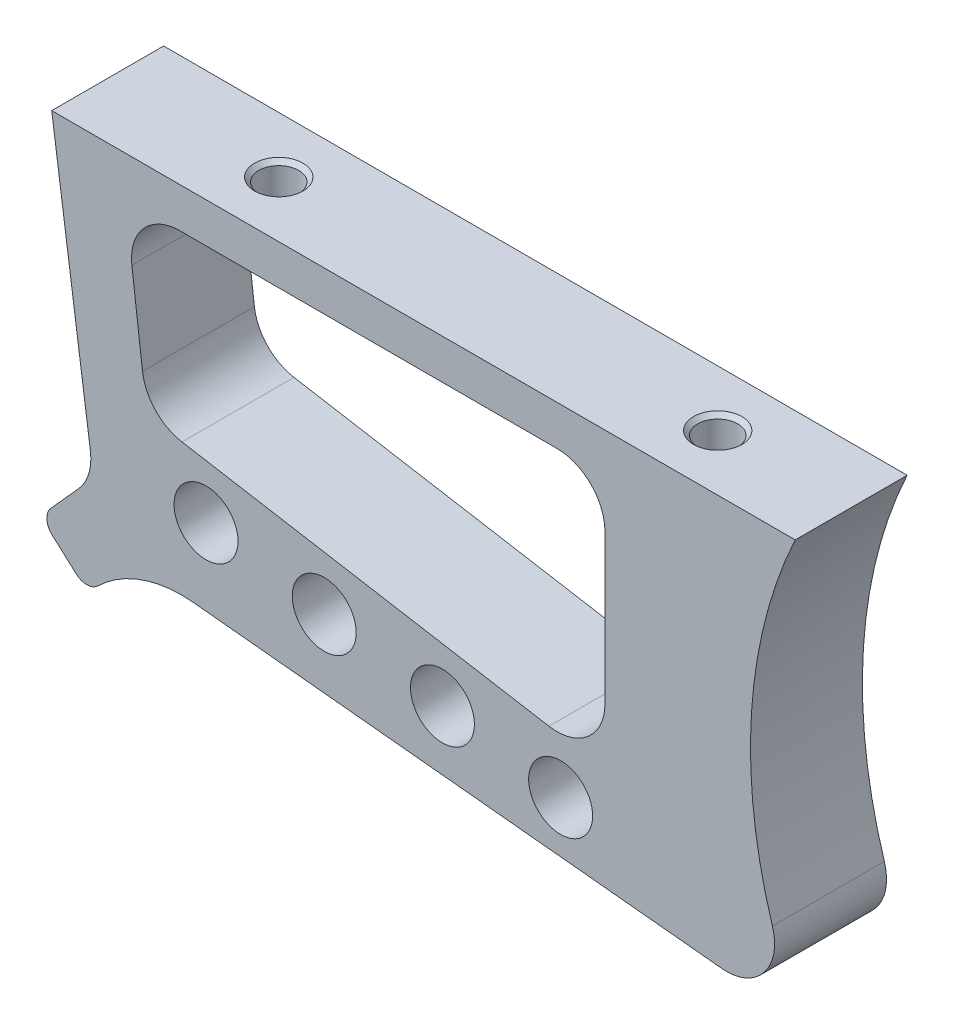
ISO-10303-21;
HEADER;
FILE_DESCRIPTION(('STEP AP214'),'2;1');
FILE_NAME('part.step','',(''),(''),'','','');
FILE_SCHEMA(('AUTOMOTIVE_DESIGN { 1 0 10303 214 1 1 1 1 }'));
ENDSEC;
DATA;
#1=APPLICATION_CONTEXT('core data for automotive mechanical design processes');
#2=APPLICATION_PROTOCOL_DEFINITION('international standard','automotive_design',2000,#1);
#3=PRODUCT_CONTEXT('',#1,'mechanical');
#4=PRODUCT('Part','Part','',(#3));
#5=PRODUCT_RELATED_PRODUCT_CATEGORY('part','',(#4));
#6=PRODUCT_DEFINITION_FORMATION('','',#4);
#7=PRODUCT_DEFINITION_CONTEXT('part definition',#1,'design');
#8=PRODUCT_DEFINITION('design','',#6,#7);
#9=PRODUCT_DEFINITION_SHAPE('','',#8);
#10=(LENGTH_UNIT() NAMED_UNIT(*) SI_UNIT(.MILLI.,.METRE.));
#11=(NAMED_UNIT(*) PLANE_ANGLE_UNIT() SI_UNIT($,.RADIAN.));
#12=(NAMED_UNIT(*) SI_UNIT($,.STERADIAN.) SOLID_ANGLE_UNIT());
#13=UNCERTAINTY_MEASURE_WITH_UNIT(LENGTH_MEASURE(1.E-05),#10,'distance_accuracy_value','');
#14=(GEOMETRIC_REPRESENTATION_CONTEXT(3) GLOBAL_UNCERTAINTY_ASSIGNED_CONTEXT((#13)) GLOBAL_UNIT_ASSIGNED_CONTEXT((#10,
#11,#12)) REPRESENTATION_CONTEXT('',''));
#15=CARTESIAN_POINT('',(0.,0.,0.));
#16=DIRECTION('',(0.,0.,1.));
#17=DIRECTION('',(1.,0.,0.));
#18=AXIS2_PLACEMENT_3D('',#15,#16,#17);
#19=CARTESIAN_POINT('',(147.4,-25.3108672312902,7.));
#20=DIRECTION('',(0.,0.,1.));
#21=DIRECTION('',(1.,0.,0.));
#22=AXIS2_PLACEMENT_3D('',#19,#20,#21);
#23=PLANE('',#22);
#24=CARTESIAN_POINT('',(48.8711040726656,-40.0546813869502,7.));
#25=DIRECTION('',(0.,0.,1.));
#26=DIRECTION('',(1.,0.,0.));
#27=AXIS2_PLACEMENT_3D('',#24,#25,#26);
#28=CIRCLE('',#27,4.);
#29=CARTESIAN_POINT('',(52.8711040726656,-40.0546813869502,7.));
#30=VERTEX_POINT('',#29);
#31=EDGE_CURVE('E237',#30,#30,#28,.T.);
#32=ORIENTED_EDGE('',*,*,#31,.F.);
#33=EDGE_LOOP('',(#32));
#34=FACE_BOUND('',#33,.T.);
#35=CARTESIAN_POINT('',(34.0855520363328,-37.5273406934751,7.));
#36=DIRECTION('',(0.,0.,1.));
#37=DIRECTION('',(1.,0.,0.));
#38=AXIS2_PLACEMENT_3D('',#35,#36,#37);
#39=CIRCLE('',#38,4.);
#40=CARTESIAN_POINT('',(38.0855520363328,-37.5273406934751,7.));
#41=VERTEX_POINT('',#40);
#42=EDGE_CURVE('E249',#41,#41,#39,.T.);
#43=ORIENTED_EDGE('',*,*,#42,.F.);
#44=EDGE_LOOP('',(#43));
#45=FACE_BOUND('',#44,.T.);
#46=DIRECTION('',(0.139173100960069,-0.99026806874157,0.));
#47=VECTOR('',#46,1.);
#48=CARTESIAN_POINT('',(4.83873415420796,-34.4293824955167,7.));
#49=LINE('',#48,#47);
#50=CARTESIAN_POINT('',(0.,0.,7.));
#51=VERTEX_POINT('',#50);
#52=CARTESIAN_POINT('',(4.83873415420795,-34.4293824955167,7.));
#53=VERTEX_POINT('',#52);
#54=EDGE_CURVE('E308',#51,#53,#49,.T.);
#55=ORIENTED_EDGE('',*,*,#54,.T.);
#56=CARTESIAN_POINT('',(-1.10287425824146,-35.2644211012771,7.));
#57=DIRECTION('',(0.,0.,-1.));
#58=DIRECTION('',(1.,0.,0.));
#59=AXIS2_PLACEMENT_3D('',#56,#57,#58);
#60=CIRCLE('',#59,5.99999999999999);
#61=CARTESIAN_POINT('',(3.35599469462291,-39.2792047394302,7.));
#62=VERTEX_POINT('',#61);
#63=EDGE_CURVE('E311',#53,#62,#60,.T.);
#64=ORIENTED_EDGE('',*,*,#63,.T.);
#65=DIRECTION('',(-0.669130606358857,-0.743144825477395,0.));
#66=VECTOR('',#65,1.);
#67=CARTESIAN_POINT('',(-0.0966096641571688,-43.1137103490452,7.));
#68=LINE('',#67,#66);
#69=CARTESIAN_POINT('',(-0.0966096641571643,-43.1137103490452,7.));
#70=VERTEX_POINT('',#69);
#71=EDGE_CURVE('E314',#62,#70,#68,.T.);
#72=ORIENTED_EDGE('',*,*,#71,.T.);
#73=CARTESIAN_POINT('',(1.38967998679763,-44.4519715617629,7.));
#74=DIRECTION('',(0.,0.,1.));
#75=DIRECTION('',(-1.,0.,0.));
#76=AXIS2_PLACEMENT_3D('',#73,#74,#75);
#77=CIRCLE('',#76,2.);
#78=CARTESIAN_POINT('',(0.051418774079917,-45.9382612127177,7.));
#79=VERTEX_POINT('',#78);
#80=EDGE_CURVE('E316',#70,#79,#77,.T.);
#81=ORIENTED_EDGE('',*,*,#80,.T.);
#82=DIRECTION('',(0.743144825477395,-0.669130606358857,0.));
#83=VECTOR('',#82,1.);
#84=CARTESIAN_POINT('',(0.051418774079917,-45.9382612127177,7.));
#85=LINE('',#84,#83);
#86=CARTESIAN_POINT('',(3.05213486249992,-48.6401181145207,7.));
#87=VERTEX_POINT('',#86);
#88=EDGE_CURVE('E318',#79,#87,#85,.T.);
#89=ORIENTED_EDGE('',*,*,#88,.T.);
#90=CARTESIAN_POINT('',(4.39039607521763,-47.1538284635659,7.));
#91=DIRECTION('',(0.,0.,1.));
#92=DIRECTION('',(1.,0.,0.));
#93=AXIS2_PLACEMENT_3D('',#90,#91,#92);
#94=CIRCLE('',#93,2.);
#95=CARTESIAN_POINT('',(5.72865728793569,-48.6401181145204,7.));
#96=VERTEX_POINT('',#95);
#97=EDGE_CURVE('E320',#87,#96,#94,.T.);
#98=ORIENTED_EDGE('',*,*,#97,.T.);
#99=DIRECTION('',(1.,5.95119006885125E-12,0.));
#100=VECTOR('',#99,1.);
#101=CARTESIAN_POINT('',(5.72865728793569,-48.6401181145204,7.));
#102=LINE('',#101,#100);
#103=CARTESIAN_POINT('',(5.73098922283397,-48.6401181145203,7.));
#104=VERTEX_POINT('',#103);
#105=EDGE_CURVE('E322',#96,#104,#102,.T.);
#106=ORIENTED_EDGE('',*,*,#105,.T.);
#107=CARTESIAN_POINT('',(16.236953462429,-59.3464113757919,7.));
#108=DIRECTION('',(0.,0.,-1.));
#109=DIRECTION('',(-1.,0.,0.));
#110=AXIS2_PLACEMENT_3D('',#107,#108,#109);
#111=CIRCLE('',#110,15.);
#112=CARTESIAN_POINT('',(17.7267497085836,-44.4205778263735,7.));
#113=VERTEX_POINT('',#112);
#114=EDGE_CURVE('E324',#104,#113,#111,.T.);
#115=ORIENTED_EDGE('',*,*,#114,.T.);
#116=DIRECTION('',(0.995055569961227,-0.0993197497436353,0.));
#117=VECTOR('',#116,1.);
#118=CARTESIAN_POINT('',(83.8242487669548,-51.0179853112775,7.));
#119=LINE('',#118,#117);
#120=CARTESIAN_POINT('',(83.8242487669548,-51.0179853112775,7.));
#121=VERTEX_POINT('',#120);
#122=EDGE_CURVE('E326',#113,#121,#119,.T.);
#123=ORIENTED_EDGE('',*,*,#122,.T.);
#124=CARTESIAN_POINT('',(84.4201672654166,-45.0476518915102,7.));
#125=DIRECTION('',(0.,0.,1.));
#126=DIRECTION('',(1.,0.,0.));
#127=AXIS2_PLACEMENT_3D('',#124,#125,#126);
#128=CIRCLE('',#127,6.);
#129=CARTESIAN_POINT('',(90.1456066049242,-43.2533987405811,7.));
#130=VERTEX_POINT('',#129);
#131=EDGE_CURVE('E328',#121,#130,#128,.T.);
#132=ORIENTED_EDGE('',*,*,#131,.T.);
#133=CARTESIAN_POINT('',(147.4,-25.3108672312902,7.));
#134=DIRECTION('',(0.,0.,-1.));
#135=DIRECTION('',(1.,0.,0.));
#136=AXIS2_PLACEMENT_3D('',#133,#134,#135);
#137=CIRCLE('',#136,60.);
#138=CARTESIAN_POINT('',(93.,0.,7.));
#139=VERTEX_POINT('',#138);
#140=EDGE_CURVE('E330',#130,#139,#137,.T.);
#141=ORIENTED_EDGE('',*,*,#140,.T.);
#142=DIRECTION('',(-1.,0.,0.));
#143=VECTOR('',#142,1.);
#144=CARTESIAN_POINT('',(0.,0.,7.));
#145=LINE('',#144,#143);
#146=EDGE_CURVE('E332',#139,#51,#145,.T.);
#147=ORIENTED_EDGE('',*,*,#146,.T.);
#148=EDGE_LOOP('',(#55,#64,#72,#81,#89,#98,#106,#115,#123,#132,#141,#147));
#149=FACE_BOUND('',#148,.T.);
#150=DIRECTION('',(0.,1.,0.));
#151=VECTOR('',#150,1.);
#152=CARTESIAN_POINT('',(69.2,-29.6715816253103,7.));
#153=LINE('',#152,#151);
#154=CARTESIAN_POINT('',(69.2,-29.6715816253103,7.));
#155=VERTEX_POINT('',#154);
#156=CARTESIAN_POINT('',(69.2,-11.,7.));
#157=VERTEX_POINT('',#156);
#158=EDGE_CURVE('E256',#155,#157,#153,.T.);
#159=ORIENTED_EDGE('',*,*,#158,.F.);
#160=CARTESIAN_POINT('',(63.2,-29.6715816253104,7.));
#161=DIRECTION('',(0.,0.,1.));
#162=DIRECTION('',(-1.,0.,0.));
#163=AXIS2_PLACEMENT_3D('',#160,#161,#162);
#164=CIRCLE('',#163,6.);
#165=CARTESIAN_POINT('',(62.1890637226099,-35.5858024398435,7.));
#166=VERTEX_POINT('',#165);
#167=EDGE_CURVE('E254',#166,#155,#164,.T.);
#168=ORIENTED_EDGE('',*,*,#167,.F.);
#169=DIRECTION('',(0.985703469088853,-0.168489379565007,0.));
#170=VECTOR('',#169,1.);
#171=CARTESIAN_POINT('',(16.3003009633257,-27.7418925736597,7.));
#172=LINE('',#171,#170);
#173=CARTESIAN_POINT('',(16.3003009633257,-27.7418925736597,7.));
#174=VERTEX_POINT('',#173);
#175=EDGE_CURVE('E269',#174,#166,#172,.T.);
#176=ORIENTED_EDGE('',*,*,#175,.F.);
#177=CARTESIAN_POINT('',(17.3112372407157,-21.8276717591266,7.));
#178=DIRECTION('',(0.,0.,1.));
#179=DIRECTION('',(-1.,0.,0.));
#180=AXIS2_PLACEMENT_3D('',#177,#178,#179);
#181=CIRCLE('',#180,6.);
#182=CARTESIAN_POINT('',(11.3559603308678,-22.5588878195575,7.));
#183=VERTEX_POINT('',#182);
#184=EDGE_CURVE('E267',#183,#174,#181,.T.);
#185=ORIENTED_EDGE('',*,*,#184,.F.);
#186=DIRECTION('',(0.121869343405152,-0.992546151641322,0.));
#187=VECTOR('',#186,1.);
#188=CARTESIAN_POINT('',(10.0264894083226,-11.731216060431,7.));
#189=LINE('',#188,#187);
#190=CARTESIAN_POINT('',(10.0264894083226,-11.731216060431,7.));
#191=VERTEX_POINT('',#190);
#192=EDGE_CURVE('E265',#191,#183,#189,.T.);
#193=ORIENTED_EDGE('',*,*,#192,.F.);
#194=CARTESIAN_POINT('',(15.9817663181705,-11.,7.));
#195=DIRECTION('',(0.,0.,1.));
#196=DIRECTION('',(-1.,0.,0.));
#197=AXIS2_PLACEMENT_3D('',#194,#195,#196);
#198=CIRCLE('',#197,6.);
#199=CARTESIAN_POINT('',(15.9817663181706,-5.00000000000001,7.));
#200=VERTEX_POINT('',#199);
#201=EDGE_CURVE('E263',#200,#191,#198,.T.);
#202=ORIENTED_EDGE('',*,*,#201,.F.);
#203=DIRECTION('',(-1.,0.,0.));
#204=VECTOR('',#203,1.);
#205=CARTESIAN_POINT('',(63.2,-5.,7.));
#206=LINE('',#205,#204);
#207=CARTESIAN_POINT('',(63.2,-4.99999999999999,7.));
#208=VERTEX_POINT('',#207);
#209=EDGE_CURVE('E261',#208,#200,#206,.T.);
#210=ORIENTED_EDGE('',*,*,#209,.F.);
#211=CARTESIAN_POINT('',(63.2,-11.,7.));
#212=DIRECTION('',(0.,0.,1.));
#213=DIRECTION('',(1.,0.,0.));
#214=AXIS2_PLACEMENT_3D('',#211,#212,#213);
#215=CIRCLE('',#214,6.);
#216=EDGE_CURVE('E259',#157,#208,#215,.T.);
#217=ORIENTED_EDGE('',*,*,#216,.F.);
#218=EDGE_LOOP('',(#159,#168,#176,#185,#193,#202,#210,#217));
#219=FACE_BOUND('',#218,.T.);
#220=CARTESIAN_POINT('',(19.3,-35.,7.));
#221=DIRECTION('',(0.,0.,1.));
#222=DIRECTION('',(1.,0.,0.));
#223=AXIS2_PLACEMENT_3D('',#220,#221,#222);
#224=CIRCLE('',#223,4.);
#225=CARTESIAN_POINT('',(23.3,-35.,7.));
#226=VERTEX_POINT('',#225);
#227=EDGE_CURVE('E243',#226,#226,#224,.T.);
#228=ORIENTED_EDGE('',*,*,#227,.F.);
#229=EDGE_LOOP('',(#228));
#230=FACE_BOUND('',#229,.T.);
#231=CARTESIAN_POINT('',(63.6566561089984,-42.5820220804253,7.));
#232=DIRECTION('',(0.,0.,1.));
#233=DIRECTION('',(1.,0.,0.));
#234=AXIS2_PLACEMENT_3D('',#231,#232,#233);
#235=CIRCLE('',#234,4.00000000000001);
#236=CARTESIAN_POINT('',(67.6566561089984,-42.5820220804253,7.));
#237=VERTEX_POINT('',#236);
#238=EDGE_CURVE('E231',#237,#237,#235,.T.);
#239=ORIENTED_EDGE('',*,*,#238,.F.);
#240=EDGE_LOOP('',(#239));
#241=FACE_BOUND('',#240,.T.);
#242=ADVANCED_FACE('F49',(#34,#45,#149,#219,#230,#241),#23,.T.);
#243=CARTESIAN_POINT('',(147.4,-25.3108672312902,-7.));
#244=DIRECTION('',(0.,0.,1.));
#245=DIRECTION('',(1.,0.,0.));
#246=AXIS2_PLACEMENT_3D('',#243,#244,#245);
#247=PLANE('',#246);
#248=DIRECTION('',(0.139173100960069,-0.99026806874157,0.));
#249=VECTOR('',#248,1.);
#250=CARTESIAN_POINT('',(4.83873415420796,-34.4293824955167,-7.));
#251=LINE('',#250,#249);
#252=CARTESIAN_POINT('',(0.,0.,-7.));
#253=VERTEX_POINT('',#252);
#254=CARTESIAN_POINT('',(4.83873415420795,-34.4293824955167,-7.));
#255=VERTEX_POINT('',#254);
#256=EDGE_CURVE('E307',#253,#255,#251,.T.);
#257=ORIENTED_EDGE('',*,*,#256,.F.);
#258=DIRECTION('',(-1.,0.,0.));
#259=VECTOR('',#258,1.);
#260=CARTESIAN_POINT('',(0.,0.,-7.));
#261=LINE('',#260,#259);
#262=CARTESIAN_POINT('',(93.,0.,-7.));
#263=VERTEX_POINT('',#262);
#264=EDGE_CURVE('E312',#263,#253,#261,.T.);
#265=ORIENTED_EDGE('',*,*,#264,.F.);
#266=CARTESIAN_POINT('',(147.4,-25.3108672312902,-7.));
#267=DIRECTION('',(0.,0.,-1.));
#268=DIRECTION('',(1.,0.,0.));
#269=AXIS2_PLACEMENT_3D('',#266,#267,#268);
#270=CIRCLE('',#269,60.);
#271=CARTESIAN_POINT('',(90.1456066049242,-43.2533987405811,-7.));
#272=VERTEX_POINT('',#271);
#273=EDGE_CURVE('E355',#272,#263,#270,.T.);
#274=ORIENTED_EDGE('',*,*,#273,.F.);
#275=CARTESIAN_POINT('',(84.4201672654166,-45.0476518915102,-7.));
#276=DIRECTION('',(0.,0.,1.));
#277=DIRECTION('',(1.,0.,0.));
#278=AXIS2_PLACEMENT_3D('',#275,#276,#277);
#279=CIRCLE('',#278,6.);
#280=CARTESIAN_POINT('',(83.8242487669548,-51.0179853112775,-7.));
#281=VERTEX_POINT('',#280);
#282=EDGE_CURVE('E353',#281,#272,#279,.T.);
#283=ORIENTED_EDGE('',*,*,#282,.F.);
#284=DIRECTION('',(0.995055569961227,-0.0993197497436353,0.));
#285=VECTOR('',#284,1.);
#286=CARTESIAN_POINT('',(83.8242487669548,-51.0179853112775,-7.));
#287=LINE('',#286,#285);
#288=CARTESIAN_POINT('',(17.7267497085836,-44.4205778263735,-7.));
#289=VERTEX_POINT('',#288);
#290=EDGE_CURVE('E351',#289,#281,#287,.T.);
#291=ORIENTED_EDGE('',*,*,#290,.F.);
#292=CARTESIAN_POINT('',(16.236953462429,-59.3464113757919,-7.));
#293=DIRECTION('',(0.,0.,-1.));
#294=DIRECTION('',(-1.,0.,0.));
#295=AXIS2_PLACEMENT_3D('',#292,#293,#294);
#296=CIRCLE('',#295,15.);
#297=CARTESIAN_POINT('',(5.73098922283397,-48.6401181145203,-7.));
#298=VERTEX_POINT('',#297);
#299=EDGE_CURVE('E349',#298,#289,#296,.T.);
#300=ORIENTED_EDGE('',*,*,#299,.F.);
#301=DIRECTION('',(1.,5.95119006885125E-12,0.));
#302=VECTOR('',#301,1.);
#303=CARTESIAN_POINT('',(5.72865728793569,-48.6401181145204,-7.));
#304=LINE('',#303,#302);
#305=CARTESIAN_POINT('',(5.72865728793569,-48.6401181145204,-7.));
#306=VERTEX_POINT('',#305);
#307=EDGE_CURVE('E347',#306,#298,#304,.T.);
#308=ORIENTED_EDGE('',*,*,#307,.F.);
#309=CARTESIAN_POINT('',(4.39039607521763,-47.1538284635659,-7.));
#310=DIRECTION('',(0.,0.,1.));
#311=DIRECTION('',(1.,0.,0.));
#312=AXIS2_PLACEMENT_3D('',#309,#310,#311);
#313=CIRCLE('',#312,2.);
#314=CARTESIAN_POINT('',(3.05213486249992,-48.6401181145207,-7.));
#315=VERTEX_POINT('',#314);
#316=EDGE_CURVE('E345',#315,#306,#313,.T.);
#317=ORIENTED_EDGE('',*,*,#316,.F.);
#318=DIRECTION('',(0.743144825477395,-0.669130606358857,0.));
#319=VECTOR('',#318,1.);
#320=CARTESIAN_POINT('',(0.051418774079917,-45.9382612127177,-7.));
#321=LINE('',#320,#319);
#322=CARTESIAN_POINT('',(0.051418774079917,-45.9382612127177,-7.));
#323=VERTEX_POINT('',#322);
#324=EDGE_CURVE('E343',#323,#315,#321,.T.);
#325=ORIENTED_EDGE('',*,*,#324,.F.);
#326=CARTESIAN_POINT('',(1.38967998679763,-44.4519715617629,-7.));
#327=DIRECTION('',(0.,0.,1.));
#328=DIRECTION('',(-1.,0.,0.));
#329=AXIS2_PLACEMENT_3D('',#326,#327,#328);
#330=CIRCLE('',#329,2.);
#331=CARTESIAN_POINT('',(-0.0966096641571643,-43.1137103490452,-7.));
#332=VERTEX_POINT('',#331);
#333=EDGE_CURVE('E341',#332,#323,#330,.T.);
#334=ORIENTED_EDGE('',*,*,#333,.F.);
#335=DIRECTION('',(-0.669130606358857,-0.743144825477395,0.));
#336=VECTOR('',#335,1.);
#337=CARTESIAN_POINT('',(-0.0966096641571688,-43.1137103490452,-7.));
#338=LINE('',#337,#336);
#339=CARTESIAN_POINT('',(3.35599469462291,-39.2792047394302,-7.));
#340=VERTEX_POINT('',#339);
#341=EDGE_CURVE('E339',#340,#332,#338,.T.);
#342=ORIENTED_EDGE('',*,*,#341,.F.);
#343=CARTESIAN_POINT('',(-1.10287425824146,-35.2644211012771,-7.));
#344=DIRECTION('',(0.,0.,-1.));
#345=DIRECTION('',(1.,0.,0.));
#346=AXIS2_PLACEMENT_3D('',#343,#344,#345);
#347=CIRCLE('',#346,5.99999999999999);
#348=EDGE_CURVE('E337',#255,#340,#347,.T.);
#349=ORIENTED_EDGE('',*,*,#348,.F.);
#350=EDGE_LOOP('',(#257,#265,#274,#283,#291,#300,#308,#317,#325,#334,#342,#349));
#351=FACE_BOUND('',#350,.T.);
#352=CARTESIAN_POINT('',(63.2,-29.6715816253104,-7.));
#353=DIRECTION('',(0.,0.,1.));
#354=DIRECTION('',(-1.,0.,0.));
#355=AXIS2_PLACEMENT_3D('',#352,#353,#354);
#356=CIRCLE('',#355,6.);
#357=CARTESIAN_POINT('',(62.1890637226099,-35.5858024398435,-7.));
#358=VERTEX_POINT('',#357);
#359=CARTESIAN_POINT('',(69.2,-29.6715816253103,-7.));
#360=VERTEX_POINT('',#359);
#361=EDGE_CURVE('E74',#358,#360,#356,.T.);
#362=ORIENTED_EDGE('',*,*,#361,.T.);
#363=DIRECTION('',(0.,1.,0.));
#364=VECTOR('',#363,1.);
#365=CARTESIAN_POINT('',(69.2,-29.6715816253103,-7.));
#366=LINE('',#365,#364);
#367=CARTESIAN_POINT('',(69.2,-11.,-7.));
#368=VERTEX_POINT('',#367);
#369=EDGE_CURVE('E273',#360,#368,#366,.T.);
#370=ORIENTED_EDGE('',*,*,#369,.T.);
#371=CARTESIAN_POINT('',(63.2,-11.,-7.));
#372=DIRECTION('',(0.,0.,1.));
#373=DIRECTION('',(1.,0.,0.));
#374=AXIS2_PLACEMENT_3D('',#371,#372,#373);
#375=CIRCLE('',#374,6.);
#376=CARTESIAN_POINT('',(63.2,-4.99999999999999,-7.));
#377=VERTEX_POINT('',#376);
#378=EDGE_CURVE('E276',#368,#377,#375,.T.);
#379=ORIENTED_EDGE('',*,*,#378,.T.);
#380=DIRECTION('',(-1.,0.,0.));
#381=VECTOR('',#380,1.);
#382=CARTESIAN_POINT('',(63.2,-5.,-7.));
#383=LINE('',#382,#381);
#384=CARTESIAN_POINT('',(15.9817663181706,-5.00000000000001,-7.));
#385=VERTEX_POINT('',#384);
#386=EDGE_CURVE('E279',#377,#385,#383,.T.);
#387=ORIENTED_EDGE('',*,*,#386,.T.);
#388=CARTESIAN_POINT('',(15.9817663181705,-11.,-7.));
#389=DIRECTION('',(0.,0.,1.));
#390=DIRECTION('',(-1.,0.,0.));
#391=AXIS2_PLACEMENT_3D('',#388,#389,#390);
#392=CIRCLE('',#391,6.);
#393=CARTESIAN_POINT('',(10.0264894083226,-11.731216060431,-7.));
#394=VERTEX_POINT('',#393);
#395=EDGE_CURVE('E282',#385,#394,#392,.T.);
#396=ORIENTED_EDGE('',*,*,#395,.T.);
#397=DIRECTION('',(0.121869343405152,-0.992546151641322,0.));
#398=VECTOR('',#397,1.);
#399=CARTESIAN_POINT('',(10.0264894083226,-11.731216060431,-7.));
#400=LINE('',#399,#398);
#401=CARTESIAN_POINT('',(11.3559603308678,-22.5588878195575,-7.));
#402=VERTEX_POINT('',#401);
#403=EDGE_CURVE('E285',#394,#402,#400,.T.);
#404=ORIENTED_EDGE('',*,*,#403,.T.);
#405=CARTESIAN_POINT('',(17.3112372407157,-21.8276717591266,-7.));
#406=DIRECTION('',(0.,0.,1.));
#407=DIRECTION('',(-1.,0.,0.));
#408=AXIS2_PLACEMENT_3D('',#405,#406,#407);
#409=CIRCLE('',#408,6.);
#410=CARTESIAN_POINT('',(16.3003009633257,-27.7418925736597,-7.));
#411=VERTEX_POINT('',#410);
#412=EDGE_CURVE('E288',#402,#411,#409,.T.);
#413=ORIENTED_EDGE('',*,*,#412,.T.);
#414=DIRECTION('',(0.985703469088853,-0.168489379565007,0.));
#415=VECTOR('',#414,1.);
#416=CARTESIAN_POINT('',(16.3003009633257,-27.7418925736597,-7.));
#417=LINE('',#416,#415);
#418=EDGE_CURVE('E257',#411,#358,#417,.T.);
#419=ORIENTED_EDGE('',*,*,#418,.T.);
#420=EDGE_LOOP('',(#362,#370,#379,#387,#396,#404,#413,#419));
#421=FACE_BOUND('',#420,.T.);
#422=CARTESIAN_POINT('',(34.0855520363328,-37.5273406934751,-7.));
#423=DIRECTION('',(0.,0.,1.));
#424=DIRECTION('',(1.,0.,0.));
#425=AXIS2_PLACEMENT_3D('',#422,#423,#424);
#426=CIRCLE('',#425,4.);
#427=CARTESIAN_POINT('',(38.0855520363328,-37.5273406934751,-7.));
#428=VERTEX_POINT('',#427);
#429=EDGE_CURVE('E246',#428,#428,#426,.T.);
#430=ORIENTED_EDGE('',*,*,#429,.T.);
#431=EDGE_LOOP('',(#430));
#432=FACE_BOUND('',#431,.T.);
#433=CARTESIAN_POINT('',(19.3,-35.,-7.));
#434=DIRECTION('',(0.,0.,1.));
#435=DIRECTION('',(1.,0.,0.));
#436=AXIS2_PLACEMENT_3D('',#433,#434,#435);
#437=CIRCLE('',#436,4.);
#438=CARTESIAN_POINT('',(23.3,-35.,-7.));
#439=VERTEX_POINT('',#438);
#440=EDGE_CURVE('E240',#439,#439,#437,.T.);
#441=ORIENTED_EDGE('',*,*,#440,.T.);
#442=EDGE_LOOP('',(#441));
#443=FACE_BOUND('',#442,.T.);
#444=CARTESIAN_POINT('',(48.8711040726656,-40.0546813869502,-7.));
#445=DIRECTION('',(0.,0.,1.));
#446=DIRECTION('',(1.,0.,0.));
#447=AXIS2_PLACEMENT_3D('',#444,#445,#446);
#448=CIRCLE('',#447,4.);
#449=CARTESIAN_POINT('',(52.8711040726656,-40.0546813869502,-7.));
#450=VERTEX_POINT('',#449);
#451=EDGE_CURVE('E234',#450,#450,#448,.T.);
#452=ORIENTED_EDGE('',*,*,#451,.T.);
#453=EDGE_LOOP('',(#452));
#454=FACE_BOUND('',#453,.T.);
#455=CARTESIAN_POINT('',(63.6566561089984,-42.5820220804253,-7.));
#456=DIRECTION('',(0.,0.,1.));
#457=DIRECTION('',(1.,0.,0.));
#458=AXIS2_PLACEMENT_3D('',#455,#456,#457);
#459=CIRCLE('',#458,4.00000000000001);
#460=CARTESIAN_POINT('',(67.6566561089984,-42.5820220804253,-7.));
#461=VERTEX_POINT('',#460);
#462=EDGE_CURVE('E230',#461,#461,#459,.T.);
#463=ORIENTED_EDGE('',*,*,#462,.T.);
#464=EDGE_LOOP('',(#463));
#465=FACE_BOUND('',#464,.T.);
#466=ADVANCED_FACE('F407',(#351,#421,#432,#443,#454,#465),#247,.F.);
#467=CARTESIAN_POINT('',(4.83873415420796,-34.4293824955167,7.));
#468=DIRECTION('',(0.99026806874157,0.139173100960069,0.));
#469=DIRECTION('',(-0.139173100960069,0.99026806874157,0.));
#470=AXIS2_PLACEMENT_3D('',#467,#468,#469);
#471=PLANE('',#470);
#472=ORIENTED_EDGE('',*,*,#256,.T.);
#473=DIRECTION('',(0.,0.,-1.));
#474=VECTOR('',#473,1.);
#475=CARTESIAN_POINT('',(4.83873415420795,-34.4293824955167,7.));
#476=LINE('',#475,#474);
#477=EDGE_CURVE('E11',#53,#255,#476,.T.);
#478=ORIENTED_EDGE('',*,*,#477,.F.);
#479=ORIENTED_EDGE('',*,*,#54,.F.);
#480=DIRECTION('',(0.,0.,-1.));
#481=VECTOR('',#480,1.);
#482=CARTESIAN_POINT('',(0.,0.,7.));
#483=LINE('',#482,#481);
#484=EDGE_CURVE('E334',#51,#253,#483,.T.);
#485=ORIENTED_EDGE('',*,*,#484,.T.);
#486=EDGE_LOOP('',(#472,#478,#479,#485));
#487=FACE_BOUND('',#486,.T.);
#488=ADVANCED_FACE('F51',(#487),#471,.F.);
#489=CARTESIAN_POINT('',(-1.10287425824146,-35.2644211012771,7.));
#490=DIRECTION('',(0.,0.,-1.));
#491=DIRECTION('',(-1.,0.,0.));
#492=AXIS2_PLACEMENT_3D('',#489,#490,#491);
#493=CYLINDRICAL_SURFACE('',#492,5.99999999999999);
#494=ORIENTED_EDGE('',*,*,#348,.T.);
#495=DIRECTION('',(0.,0.,-1.));
#496=VECTOR('',#495,1.);
#497=CARTESIAN_POINT('',(3.35599469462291,-39.2792047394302,7.));
#498=LINE('',#497,#496);
#499=EDGE_CURVE('E58',#62,#340,#498,.T.);
#500=ORIENTED_EDGE('',*,*,#499,.F.);
#501=ORIENTED_EDGE('',*,*,#63,.F.);
#502=ORIENTED_EDGE('',*,*,#477,.T.);
#503=EDGE_LOOP('',(#494,#500,#501,#502));
#504=FACE_BOUND('',#503,.T.);
#505=ADVANCED_FACE('F491',(#504),#493,.F.);
#506=CARTESIAN_POINT('',(-0.0966096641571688,-43.1137103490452,7.));
#507=DIRECTION('',(0.743144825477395,-0.669130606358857,0.));
#508=DIRECTION('',(0.669130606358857,0.743144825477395,0.));
#509=AXIS2_PLACEMENT_3D('',#506,#507,#508);
#510=PLANE('',#509);
#511=ORIENTED_EDGE('',*,*,#341,.T.);
#512=DIRECTION('',(0.,0.,-1.));
#513=VECTOR('',#512,1.);
#514=CARTESIAN_POINT('',(-0.0966096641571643,-43.1137103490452,7.));
#515=LINE('',#514,#513);
#516=EDGE_CURVE('E384',#70,#332,#515,.T.);
#517=ORIENTED_EDGE('',*,*,#516,.F.);
#518=ORIENTED_EDGE('',*,*,#71,.F.);
#519=ORIENTED_EDGE('',*,*,#499,.T.);
#520=EDGE_LOOP('',(#511,#517,#518,#519));
#521=FACE_BOUND('',#520,.T.);
#522=ADVANCED_FACE('F488',(#521),#510,.F.);
#523=CARTESIAN_POINT('',(1.38967998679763,-44.4519715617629,7.));
#524=DIRECTION('',(0.,0.,-1.));
#525=DIRECTION('',(-1.,0.,0.));
#526=AXIS2_PLACEMENT_3D('',#523,#524,#525);
#527=CYLINDRICAL_SURFACE('',#526,2.);
#528=ORIENTED_EDGE('',*,*,#333,.T.);
#529=DIRECTION('',(0.,0.,-1.));
#530=VECTOR('',#529,1.);
#531=CARTESIAN_POINT('',(0.051418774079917,-45.9382612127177,7.));
#532=LINE('',#531,#530);
#533=EDGE_CURVE('E381',#79,#323,#532,.T.);
#534=ORIENTED_EDGE('',*,*,#533,.F.);
#535=ORIENTED_EDGE('',*,*,#80,.F.);
#536=ORIENTED_EDGE('',*,*,#516,.T.);
#537=EDGE_LOOP('',(#528,#534,#535,#536));
#538=FACE_BOUND('',#537,.T.);
#539=ADVANCED_FACE('F484',(#538),#527,.T.);
#540=CARTESIAN_POINT('',(0.051418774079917,-45.9382612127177,7.));
#541=DIRECTION('',(0.669130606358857,0.743144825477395,0.));
#542=DIRECTION('',(-0.743144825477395,0.669130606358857,0.));
#543=AXIS2_PLACEMENT_3D('',#540,#541,#542);
#544=PLANE('',#543);
#545=ORIENTED_EDGE('',*,*,#324,.T.);
#546=DIRECTION('',(0.,0.,-1.));
#547=VECTOR('',#546,1.);
#548=CARTESIAN_POINT('',(3.05213486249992,-48.6401181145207,7.));
#549=LINE('',#548,#547);
#550=EDGE_CURVE('E378',#87,#315,#549,.T.);
#551=ORIENTED_EDGE('',*,*,#550,.F.);
#552=ORIENTED_EDGE('',*,*,#88,.F.);
#553=ORIENTED_EDGE('',*,*,#533,.T.);
#554=EDGE_LOOP('',(#545,#551,#552,#553));
#555=FACE_BOUND('',#554,.T.);
#556=ADVANCED_FACE('F480',(#555),#544,.F.);
#557=CARTESIAN_POINT('',(4.39039607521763,-47.1538284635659,7.));
#558=DIRECTION('',(0.,0.,-1.));
#559=DIRECTION('',(-1.,0.,0.));
#560=AXIS2_PLACEMENT_3D('',#557,#558,#559);
#561=CYLINDRICAL_SURFACE('',#560,2.);
#562=ORIENTED_EDGE('',*,*,#316,.T.);
#563=DIRECTION('',(0.,0.,-1.));
#564=VECTOR('',#563,1.);
#565=CARTESIAN_POINT('',(5.72865728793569,-48.6401181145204,7.));
#566=LINE('',#565,#564);
#567=EDGE_CURVE('E375',#96,#306,#566,.T.);
#568=ORIENTED_EDGE('',*,*,#567,.F.);
#569=ORIENTED_EDGE('',*,*,#97,.F.);
#570=ORIENTED_EDGE('',*,*,#550,.T.);
#571=EDGE_LOOP('',(#562,#568,#569,#570));
#572=FACE_BOUND('',#571,.T.);
#573=ADVANCED_FACE('F476',(#572),#561,.T.);
#574=CARTESIAN_POINT('',(5.72865728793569,-48.6401181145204,7.));
#575=DIRECTION('',(-5.95119006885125E-12,1.,0.));
#576=DIRECTION('',(-1.,-5.95119006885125E-12,0.));
#577=AXIS2_PLACEMENT_3D('',#574,#575,#576);
#578=PLANE('',#577);
#579=ORIENTED_EDGE('',*,*,#307,.T.);
#580=DIRECTION('',(0.,0.,-1.));
#581=VECTOR('',#580,1.);
#582=CARTESIAN_POINT('',(5.73098922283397,-48.6401181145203,7.));
#583=LINE('',#582,#581);
#584=EDGE_CURVE('E372',#104,#298,#583,.T.);
#585=ORIENTED_EDGE('',*,*,#584,.F.);
#586=ORIENTED_EDGE('',*,*,#105,.F.);
#587=ORIENTED_EDGE('',*,*,#567,.T.);
#588=EDGE_LOOP('',(#579,#585,#586,#587));
#589=FACE_BOUND('',#588,.T.);
#590=ADVANCED_FACE('F472',(#589),#578,.F.);
#591=CARTESIAN_POINT('',(16.236953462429,-59.3464113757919,7.));
#592=DIRECTION('',(0.,0.,-1.));
#593=DIRECTION('',(-1.,0.,0.));
#594=AXIS2_PLACEMENT_3D('',#591,#592,#593);
#595=CYLINDRICAL_SURFACE('',#594,15.);
#596=ORIENTED_EDGE('',*,*,#299,.T.);
#597=DIRECTION('',(0.,0.,-1.));
#598=VECTOR('',#597,1.);
#599=CARTESIAN_POINT('',(17.7267497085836,-44.4205778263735,7.));
#600=LINE('',#599,#598);
#601=EDGE_CURVE('E369',#113,#289,#600,.T.);
#602=ORIENTED_EDGE('',*,*,#601,.F.);
#603=ORIENTED_EDGE('',*,*,#114,.F.);
#604=ORIENTED_EDGE('',*,*,#584,.T.);
#605=EDGE_LOOP('',(#596,#602,#603,#604));
#606=FACE_BOUND('',#605,.T.);
#607=ADVANCED_FACE('F468',(#606),#595,.F.);
#608=CARTESIAN_POINT('',(83.8242487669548,-51.0179853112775,7.));
#609=DIRECTION('',(0.0993197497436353,0.995055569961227,0.));
#610=DIRECTION('',(-0.995055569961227,0.0993197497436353,0.));
#611=AXIS2_PLACEMENT_3D('',#608,#609,#610);
#612=PLANE('',#611);
#613=CARTESIAN_POINT('',(74.4,-50.0773202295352,0.));
#614=DIRECTION('',(0.0993197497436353,0.995055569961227,0.));
#615=DIRECTION('',(-0.995055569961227,0.0993197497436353,0.));
#616=AXIS2_PLACEMENT_3D('',#613,#614,#615);
#617=ELLIPSE('',#616,6.02981399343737,6.);
#618=CARTESIAN_POINT('',(68.4,-49.4784406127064,0.));
#619=VERTEX_POINT('',#618);
#620=EDGE_CURVE('E53',#619,#619,#617,.T.);
#621=ORIENTED_EDGE('',*,*,#620,.T.);
#622=EDGE_LOOP('',(#621));
#623=FACE_BOUND('',#622,.T.);
#624=ORIENTED_EDGE('',*,*,#290,.T.);
#625=DIRECTION('',(0.,0.,-1.));
#626=VECTOR('',#625,1.);
#627=CARTESIAN_POINT('',(83.8242487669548,-51.0179853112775,7.));
#628=LINE('',#627,#626);
#629=EDGE_CURVE('E366',#121,#281,#628,.T.);
#630=ORIENTED_EDGE('',*,*,#629,.F.);
#631=ORIENTED_EDGE('',*,*,#122,.F.);
#632=ORIENTED_EDGE('',*,*,#601,.T.);
#633=EDGE_LOOP('',(#624,#630,#631,#632));
#634=FACE_BOUND('',#633,.T.);
#635=ADVANCED_FACE('F464',(#623,#634),#612,.F.);
#636=CARTESIAN_POINT('',(84.4201672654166,-45.0476518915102,7.));
#637=DIRECTION('',(0.,0.,-1.));
#638=DIRECTION('',(-1.,0.,0.));
#639=AXIS2_PLACEMENT_3D('',#636,#637,#638);
#640=CYLINDRICAL_SURFACE('',#639,6.);
#641=ORIENTED_EDGE('',*,*,#282,.T.);
#642=DIRECTION('',(0.,0.,-1.));
#643=VECTOR('',#642,1.);
#644=CARTESIAN_POINT('',(90.1456066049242,-43.2533987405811,7.));
#645=LINE('',#644,#643);
#646=EDGE_CURVE('E363',#130,#272,#645,.T.);
#647=ORIENTED_EDGE('',*,*,#646,.F.);
#648=ORIENTED_EDGE('',*,*,#131,.F.);
#649=ORIENTED_EDGE('',*,*,#629,.T.);
#650=EDGE_LOOP('',(#641,#647,#648,#649));
#651=FACE_BOUND('',#650,.T.);
#652=ADVANCED_FACE('F460',(#651),#640,.T.);
#653=CARTESIAN_POINT('',(147.4,-25.3108672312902,7.));
#654=DIRECTION('',(0.,0.,-1.));
#655=DIRECTION('',(-1.,0.,0.));
#656=AXIS2_PLACEMENT_3D('',#653,#654,#655);
#657=CYLINDRICAL_SURFACE('',#656,60.);
#658=ORIENTED_EDGE('',*,*,#273,.T.);
#659=DIRECTION('',(0.,0.,-1.));
#660=VECTOR('',#659,1.);
#661=CARTESIAN_POINT('',(93.,0.,7.));
#662=LINE('',#661,#660);
#663=EDGE_CURVE('E360',#139,#263,#662,.T.);
#664=ORIENTED_EDGE('',*,*,#663,.F.);
#665=ORIENTED_EDGE('',*,*,#140,.F.);
#666=ORIENTED_EDGE('',*,*,#646,.T.);
#667=EDGE_LOOP('',(#658,#664,#665,#666));
#668=FACE_BOUND('',#667,.T.);
#669=ADVANCED_FACE('F456',(#668),#657,.F.);
#670=CARTESIAN_POINT('',(0.,0.,7.));
#671=DIRECTION('',(0.,-1.,0.));
#672=DIRECTION('',(0.,0.,-1.));
#673=AXIS2_PLACEMENT_3D('',#670,#671,#672);
#674=PLANE('',#673);
#675=CARTESIAN_POINT('',(21.4,0.,0.));
#676=DIRECTION('',(0.,1.,0.));
#677=DIRECTION('',(0.,0.,1.));
#678=AXIS2_PLACEMENT_3D('',#675,#676,#677);
#679=CIRCLE('',#678,3.025);
#680=CARTESIAN_POINT('',(21.4,0.,3.025));
#681=VERTEX_POINT('',#680);
#682=EDGE_CURVE('E214',#681,#681,#679,.T.);
#683=ORIENTED_EDGE('',*,*,#682,.F.);
#684=EDGE_LOOP('',(#683));
#685=FACE_BOUND('',#684,.T.);
#686=CARTESIAN_POINT('',(76.3033903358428,0.,0.));
#687=DIRECTION('',(0.,1.,0.));
#688=DIRECTION('',(0.,0.,1.));
#689=AXIS2_PLACEMENT_3D('',#686,#687,#688);
#690=CIRCLE('',#689,3.025);
#691=CARTESIAN_POINT('',(76.3033903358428,0.,3.025));
#692=VERTEX_POINT('',#691);
#693=EDGE_CURVE('E221',#692,#692,#690,.T.);
#694=ORIENTED_EDGE('',*,*,#693,.F.);
#695=EDGE_LOOP('',(#694));
#696=FACE_BOUND('',#695,.T.);
#697=ORIENTED_EDGE('',*,*,#264,.T.);
#698=ORIENTED_EDGE('',*,*,#484,.F.);
#699=ORIENTED_EDGE('',*,*,#146,.F.);
#700=ORIENTED_EDGE('',*,*,#663,.T.);
#701=EDGE_LOOP('',(#697,#698,#699,#700));
#702=FACE_BOUND('',#701,.T.);
#703=ADVANCED_FACE('F441',(#685,#696,#702),#674,.F.);
#704=CARTESIAN_POINT('',(63.2,-29.6715816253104,7.));
#705=DIRECTION('',(0.,0.,-1.));
#706=DIRECTION('',(-1.,0.,0.));
#707=AXIS2_PLACEMENT_3D('',#704,#705,#706);
#708=CYLINDRICAL_SURFACE('',#707,6.);
#709=ORIENTED_EDGE('',*,*,#361,.F.);
#710=DIRECTION('',(0.,0.,-1.));
#711=VECTOR('',#710,1.);
#712=CARTESIAN_POINT('',(62.1890637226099,-35.5858024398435,7.));
#713=LINE('',#712,#711);
#714=EDGE_CURVE('E271',#166,#358,#713,.T.);
#715=ORIENTED_EDGE('',*,*,#714,.F.);
#716=ORIENTED_EDGE('',*,*,#167,.T.);
#717=DIRECTION('',(0.,0.,-1.));
#718=VECTOR('',#717,1.);
#719=CARTESIAN_POINT('',(69.2,-29.6715816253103,7.));
#720=LINE('',#719,#718);
#721=EDGE_CURVE('E305',#155,#360,#720,.T.);
#722=ORIENTED_EDGE('',*,*,#721,.T.);
#723=EDGE_LOOP('',(#709,#715,#716,#722));
#724=FACE_BOUND('',#723,.T.);
#725=ADVANCED_FACE('F430',(#724),#708,.F.);
#726=CARTESIAN_POINT('',(69.2,-29.6715816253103,7.));
#727=DIRECTION('',(-1.,0.,0.));
#728=DIRECTION('',(0.,0.,1.));
#729=AXIS2_PLACEMENT_3D('',#726,#727,#728);
#730=PLANE('',#729);
#731=ORIENTED_EDGE('',*,*,#369,.F.);
#732=ORIENTED_EDGE('',*,*,#721,.F.);
#733=ORIENTED_EDGE('',*,*,#158,.T.);
#734=DIRECTION('',(0.,0.,-1.));
#735=VECTOR('',#734,1.);
#736=CARTESIAN_POINT('',(69.2,-11.,7.));
#737=LINE('',#736,#735);
#738=EDGE_CURVE('E303',#157,#368,#737,.T.);
#739=ORIENTED_EDGE('',*,*,#738,.T.);
#740=EDGE_LOOP('',(#731,#732,#733,#739));
#741=FACE_BOUND('',#740,.T.);
#742=ADVANCED_FACE('F433',(#741),#730,.T.);
#743=CARTESIAN_POINT('',(63.2,-11.,7.));
#744=DIRECTION('',(0.,0.,-1.));
#745=DIRECTION('',(-1.,0.,0.));
#746=AXIS2_PLACEMENT_3D('',#743,#744,#745);
#747=CYLINDRICAL_SURFACE('',#746,6.);
#748=ORIENTED_EDGE('',*,*,#378,.F.);
#749=ORIENTED_EDGE('',*,*,#738,.F.);
#750=ORIENTED_EDGE('',*,*,#216,.T.);
#751=DIRECTION('',(0.,0.,-1.));
#752=VECTOR('',#751,1.);
#753=CARTESIAN_POINT('',(63.2,-4.99999999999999,7.));
#754=LINE('',#753,#752);
#755=EDGE_CURVE('E301',#208,#377,#754,.T.);
#756=ORIENTED_EDGE('',*,*,#755,.T.);
#757=EDGE_LOOP('',(#748,#749,#750,#756));
#758=FACE_BOUND('',#757,.T.);
#759=ADVANCED_FACE('F398',(#758),#747,.F.);
#760=CARTESIAN_POINT('',(63.2,-5.,7.));
#761=DIRECTION('',(0.,-1.,0.));
#762=DIRECTION('',(1.,0.,0.));
#763=AXIS2_PLACEMENT_3D('',#760,#761,#762);
#764=PLANE('',#763);
#765=CARTESIAN_POINT('',(21.4,-5.,0.));
#766=DIRECTION('',(0.,-1.,0.));
#767=DIRECTION('',(1.,0.,0.));
#768=AXIS2_PLACEMENT_3D('',#765,#766,#767);
#769=CIRCLE('',#768,2.5);
#770=CARTESIAN_POINT('',(23.9,-5.,0.));
#771=VERTEX_POINT('',#770);
#772=EDGE_CURVE('E220',#771,#771,#769,.T.);
#773=ORIENTED_EDGE('',*,*,#772,.F.);
#774=EDGE_LOOP('',(#773));
#775=FACE_BOUND('',#774,.T.);
#776=ORIENTED_EDGE('',*,*,#386,.F.);
#777=ORIENTED_EDGE('',*,*,#755,.F.);
#778=ORIENTED_EDGE('',*,*,#209,.T.);
#779=DIRECTION('',(0.,0.,-1.));
#780=VECTOR('',#779,1.);
#781=CARTESIAN_POINT('',(15.9817663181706,-5.00000000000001,7.));
#782=LINE('',#781,#780);
#783=EDGE_CURVE('E299',#200,#385,#782,.T.);
#784=ORIENTED_EDGE('',*,*,#783,.T.);
#785=EDGE_LOOP('',(#776,#777,#778,#784));
#786=FACE_BOUND('',#785,.T.);
#787=ADVANCED_FACE('F394',(#775,#786),#764,.T.);
#788=CARTESIAN_POINT('',(15.9817663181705,-11.,7.));
#789=DIRECTION('',(0.,0.,-1.));
#790=DIRECTION('',(-1.,0.,0.));
#791=AXIS2_PLACEMENT_3D('',#788,#789,#790);
#792=CYLINDRICAL_SURFACE('',#791,6.);
#793=ORIENTED_EDGE('',*,*,#395,.F.);
#794=ORIENTED_EDGE('',*,*,#783,.F.);
#795=ORIENTED_EDGE('',*,*,#201,.T.);
#796=DIRECTION('',(0.,0.,-1.));
#797=VECTOR('',#796,1.);
#798=CARTESIAN_POINT('',(10.0264894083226,-11.731216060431,7.));
#799=LINE('',#798,#797);
#800=EDGE_CURVE('E297',#191,#394,#799,.T.);
#801=ORIENTED_EDGE('',*,*,#800,.T.);
#802=EDGE_LOOP('',(#793,#794,#795,#801));
#803=FACE_BOUND('',#802,.T.);
#804=ADVANCED_FACE('F397',(#803),#792,.F.);
#805=CARTESIAN_POINT('',(10.0264894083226,-11.731216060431,7.));
#806=DIRECTION('',(0.992546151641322,0.121869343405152,0.));
#807=DIRECTION('',(-0.121869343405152,0.992546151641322,0.));
#808=AXIS2_PLACEMENT_3D('',#805,#806,#807);
#809=PLANE('',#808);
#810=ORIENTED_EDGE('',*,*,#403,.F.);
#811=ORIENTED_EDGE('',*,*,#800,.F.);
#812=ORIENTED_EDGE('',*,*,#192,.T.);
#813=DIRECTION('',(0.,0.,-1.));
#814=VECTOR('',#813,1.);
#815=CARTESIAN_POINT('',(11.3559603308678,-22.5588878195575,7.));
#816=LINE('',#815,#814);
#817=EDGE_CURVE('E295',#183,#402,#816,.T.);
#818=ORIENTED_EDGE('',*,*,#817,.T.);
#819=EDGE_LOOP('',(#810,#811,#812,#818));
#820=FACE_BOUND('',#819,.T.);
#821=ADVANCED_FACE('F423',(#820),#809,.T.);
#822=CARTESIAN_POINT('',(17.3112372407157,-21.8276717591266,7.));
#823=DIRECTION('',(0.,0.,-1.));
#824=DIRECTION('',(-1.,0.,0.));
#825=AXIS2_PLACEMENT_3D('',#822,#823,#824);
#826=CYLINDRICAL_SURFACE('',#825,6.);
#827=ORIENTED_EDGE('',*,*,#412,.F.);
#828=ORIENTED_EDGE('',*,*,#817,.F.);
#829=ORIENTED_EDGE('',*,*,#184,.T.);
#830=DIRECTION('',(0.,0.,-1.));
#831=VECTOR('',#830,1.);
#832=CARTESIAN_POINT('',(16.3003009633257,-27.7418925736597,7.));
#833=LINE('',#832,#831);
#834=EDGE_CURVE('E66',#174,#411,#833,.T.);
#835=ORIENTED_EDGE('',*,*,#834,.T.);
#836=EDGE_LOOP('',(#827,#828,#829,#835));
#837=FACE_BOUND('',#836,.T.);
#838=ADVANCED_FACE('F427',(#837),#826,.F.);
#839=CARTESIAN_POINT('',(16.3003009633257,-27.7418925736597,7.));
#840=DIRECTION('',(0.168489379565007,0.985703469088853,0.));
#841=DIRECTION('',(-0.985703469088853,0.168489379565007,0.));
#842=AXIS2_PLACEMENT_3D('',#839,#840,#841);
#843=PLANE('',#842);
#844=ORIENTED_EDGE('',*,*,#418,.F.);
#845=ORIENTED_EDGE('',*,*,#834,.F.);
#846=ORIENTED_EDGE('',*,*,#175,.T.);
#847=ORIENTED_EDGE('',*,*,#714,.T.);
#848=EDGE_LOOP('',(#844,#845,#846,#847));
#849=FACE_BOUND('',#848,.T.);
#850=ADVANCED_FACE('F429',(#849),#843,.T.);
#851=CARTESIAN_POINT('',(34.0855520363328,-37.5273406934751,7.));
#852=DIRECTION('',(0.,0.,-1.));
#853=DIRECTION('',(-1.,0.,0.));
#854=AXIS2_PLACEMENT_3D('',#851,#852,#853);
#855=CYLINDRICAL_SURFACE('',#854,4.);
#856=ORIENTED_EDGE('',*,*,#42,.T.);
#857=EDGE_LOOP('',(#856));
#858=FACE_BOUND('',#857,.T.);
#859=ORIENTED_EDGE('',*,*,#429,.F.);
#860=EDGE_LOOP('',(#859));
#861=FACE_BOUND('',#860,.T.);
#862=ADVANCED_FACE('F652',(#858,#861),#855,.F.);
#863=CARTESIAN_POINT('',(19.3,-35.,7.));
#864=DIRECTION('',(0.,0.,-1.));
#865=DIRECTION('',(-1.,0.,0.));
#866=AXIS2_PLACEMENT_3D('',#863,#864,#865);
#867=CYLINDRICAL_SURFACE('',#866,4.);
#868=ORIENTED_EDGE('',*,*,#227,.T.);
#869=EDGE_LOOP('',(#868));
#870=FACE_BOUND('',#869,.T.);
#871=ORIENTED_EDGE('',*,*,#440,.F.);
#872=EDGE_LOOP('',(#871));
#873=FACE_BOUND('',#872,.T.);
#874=ADVANCED_FACE('F660',(#870,#873),#867,.F.);
#875=CARTESIAN_POINT('',(48.8711040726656,-40.0546813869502,7.));
#876=DIRECTION('',(0.,0.,-1.));
#877=DIRECTION('',(-1.,0.,0.));
#878=AXIS2_PLACEMENT_3D('',#875,#876,#877);
#879=CYLINDRICAL_SURFACE('',#878,4.);
#880=ORIENTED_EDGE('',*,*,#31,.T.);
#881=EDGE_LOOP('',(#880));
#882=FACE_BOUND('',#881,.T.);
#883=ORIENTED_EDGE('',*,*,#451,.F.);
#884=EDGE_LOOP('',(#883));
#885=FACE_BOUND('',#884,.T.);
#886=ADVANCED_FACE('F669',(#882,#885),#879,.F.);
#887=CARTESIAN_POINT('',(63.6566561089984,-42.5820220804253,7.));
#888=DIRECTION('',(0.,0.,-1.));
#889=DIRECTION('',(-1.,0.,0.));
#890=AXIS2_PLACEMENT_3D('',#887,#888,#889);
#891=CYLINDRICAL_SURFACE('',#890,4.00000000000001);
#892=ORIENTED_EDGE('',*,*,#238,.T.);
#893=EDGE_LOOP('',(#892));
#894=FACE_BOUND('',#893,.T.);
#895=ORIENTED_EDGE('',*,*,#462,.F.);
#896=EDGE_LOOP('',(#895));
#897=FACE_BOUND('',#896,.T.);
#898=ADVANCED_FACE('F678',(#894,#897),#891,.F.);
#899=CARTESIAN_POINT('',(76.3033903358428,-12.,0.));
#900=DIRECTION('',(0.,1.,0.));
#901=DIRECTION('',(0.,0.,1.));
#902=AXIS2_PLACEMENT_3D('',#899,#900,#901);
#903=CONICAL_SURFACE('',#902,2.5,1.02974425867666);
#904=CARTESIAN_POINT('',(76.3033903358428,-13.5021515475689,0.));
#905=VERTEX_POINT('',#904);
#906=VERTEX_LOOP('',#905);
#907=FACE_BOUND('',#906,.T.);
#908=CARTESIAN_POINT('',(76.3033903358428,-12.,0.));
#909=DIRECTION('',(0.,1.,0.));
#910=DIRECTION('',(0.,0.,1.));
#911=AXIS2_PLACEMENT_3D('',#908,#909,#910);
#912=CIRCLE('',#911,2.5);
#913=CARTESIAN_POINT('',(76.3033903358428,-12.,2.5));
#914=VERTEX_POINT('',#913);
#915=EDGE_CURVE('E227',#914,#914,#912,.T.);
#916=ORIENTED_EDGE('',*,*,#915,.T.);
#917=EDGE_LOOP('',(#916));
#918=FACE_BOUND('',#917,.T.);
#919=ADVANCED_FACE('F687',(#907,#918),#903,.F.);
#920=CARTESIAN_POINT('',(76.3033903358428,0.,0.));
#921=DIRECTION('',(0.,1.,0.));
#922=DIRECTION('',(0.,0.,1.));
#923=AXIS2_PLACEMENT_3D('',#920,#921,#922);
#924=CYLINDRICAL_SURFACE('',#923,2.5);
#925=ORIENTED_EDGE('',*,*,#915,.F.);
#926=EDGE_LOOP('',(#925));
#927=FACE_BOUND('',#926,.T.);
#928=CARTESIAN_POINT('',(76.3033903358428,-0.525000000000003,0.));
#929=DIRECTION('',(0.,1.,0.));
#930=DIRECTION('',(0.,0.,1.));
#931=AXIS2_PLACEMENT_3D('',#928,#929,#930);
#932=CIRCLE('',#931,2.5);
#933=CARTESIAN_POINT('',(76.3033903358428,-0.525000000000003,2.5));
#934=VERTEX_POINT('',#933);
#935=EDGE_CURVE('E224',#934,#934,#932,.T.);
#936=ORIENTED_EDGE('',*,*,#935,.T.);
#937=EDGE_LOOP('',(#936));
#938=FACE_BOUND('',#937,.T.);
#939=ADVANCED_FACE('F696',(#927,#938),#924,.F.);
#940=CARTESIAN_POINT('',(76.3033903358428,0.,0.));
#941=DIRECTION('',(0.,1.,0.));
#942=DIRECTION('',(0.,0.,1.));
#943=AXIS2_PLACEMENT_3D('',#940,#941,#942);
#944=CONICAL_SURFACE('',#943,3.025,0.785398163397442);
#945=ORIENTED_EDGE('',*,*,#935,.F.);
#946=EDGE_LOOP('',(#945));
#947=FACE_BOUND('',#946,.T.);
#948=ORIENTED_EDGE('',*,*,#693,.T.);
#949=EDGE_LOOP('',(#948));
#950=FACE_BOUND('',#949,.T.);
#951=ADVANCED_FACE('F705',(#947,#950),#944,.F.);
#952=CARTESIAN_POINT('',(21.4,0.,0.));
#953=DIRECTION('',(0.,1.,0.));
#954=DIRECTION('',(0.,0.,1.));
#955=AXIS2_PLACEMENT_3D('',#952,#953,#954);
#956=CYLINDRICAL_SURFACE('',#955,2.5);
#957=ORIENTED_EDGE('',*,*,#772,.T.);
#958=EDGE_LOOP('',(#957));
#959=FACE_BOUND('',#958,.T.);
#960=CARTESIAN_POINT('',(21.4,-0.525000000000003,0.));
#961=DIRECTION('',(0.,1.,0.));
#962=DIRECTION('',(0.,0.,1.));
#963=AXIS2_PLACEMENT_3D('',#960,#961,#962);
#964=CIRCLE('',#963,2.5);
#965=CARTESIAN_POINT('',(21.4,-0.525000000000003,2.5));
#966=VERTEX_POINT('',#965);
#967=EDGE_CURVE('E217',#966,#966,#964,.T.);
#968=ORIENTED_EDGE('',*,*,#967,.T.);
#969=EDGE_LOOP('',(#968));
#970=FACE_BOUND('',#969,.T.);
#971=ADVANCED_FACE('F391',(#959,#970),#956,.F.);
#972=CARTESIAN_POINT('',(21.4,0.,0.));
#973=DIRECTION('',(0.,1.,0.));
#974=DIRECTION('',(0.,0.,1.));
#975=AXIS2_PLACEMENT_3D('',#972,#973,#974);
#976=CONICAL_SURFACE('',#975,3.025,0.785398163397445);
#977=ORIENTED_EDGE('',*,*,#967,.F.);
#978=EDGE_LOOP('',(#977));
#979=FACE_BOUND('',#978,.T.);
#980=ORIENTED_EDGE('',*,*,#682,.T.);
#981=EDGE_LOOP('',(#980));
#982=FACE_BOUND('',#981,.T.);
#983=ADVANCED_FACE('F724',(#979,#982),#976,.F.);
#984=CARTESIAN_POINT('',(74.4,-61.5,0.));
#985=DIRECTION('',(0.,1.,0.));
#986=DIRECTION('',(0.,0.,1.));
#987=AXIS2_PLACEMENT_3D('',#984,#985,#986);
#988=CYLINDRICAL_SURFACE('',#987,6.);
#989=CARTESIAN_POINT('',(74.4,-47.5,0.));
#990=DIRECTION('',(0.,1.,0.));
#991=DIRECTION('',(0.,0.,1.));
#992=AXIS2_PLACEMENT_3D('',#989,#990,#991);
#993=CIRCLE('',#992,6.);
#994=CARTESIAN_POINT('',(74.4,-47.5,6.));
#995=VERTEX_POINT('',#994);
#996=EDGE_CURVE('E204',#995,#995,#993,.T.);
#997=ORIENTED_EDGE('',*,*,#996,.T.);
#998=EDGE_LOOP('',(#997));
#999=FACE_BOUND('',#998,.T.);
#1000=ORIENTED_EDGE('',*,*,#620,.F.);
#1001=EDGE_LOOP('',(#1000));
#1002=FACE_BOUND('',#1001,.T.);
#1003=ADVANCED_FACE('F733',(#999,#1002),#988,.F.);
#1004=CARTESIAN_POINT('',(74.4,-47.5,0.));
#1005=DIRECTION('',(0.,1.,0.));
#1006=DIRECTION('',(0.,0.,1.));
#1007=AXIS2_PLACEMENT_3D('',#1004,#1005,#1006);
#1008=PLANE('',#1007);
#1009=CARTESIAN_POINT('',(74.3942356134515,-47.5,0.));
#1010=DIRECTION('',(0.,-1.,0.));
#1011=DIRECTION('',(0.,0.,-1.));
#1012=AXIS2_PLACEMENT_3D('',#1009,#1010,#1011);
#1013=CIRCLE('',#1012,3.025);
#1014=CARTESIAN_POINT('',(74.3942356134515,-47.5,-3.025));
#1015=VERTEX_POINT('',#1014);
#1016=EDGE_CURVE('E210',#1015,#1015,#1013,.T.);
#1017=ORIENTED_EDGE('',*,*,#1016,.F.);
#1018=EDGE_LOOP('',(#1017));
#1019=FACE_BOUND('',#1018,.T.);
#1020=ORIENTED_EDGE('',*,*,#996,.F.);
#1021=EDGE_LOOP('',(#1020));
#1022=FACE_BOUND('',#1021,.T.);
#1023=ADVANCED_FACE('F198',(#1019,#1022),#1008,.F.);
#1024=CARTESIAN_POINT('',(74.3942356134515,-32.5,0.));
#1025=DIRECTION('',(0.,-1.,0.));
#1026=DIRECTION('',(0.,0.,-1.));
#1027=AXIS2_PLACEMENT_3D('',#1024,#1025,#1026);
#1028=CONICAL_SURFACE('',#1027,2.5,1.02974425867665);
#1029=CARTESIAN_POINT('',(74.3942356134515,-30.9978484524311,0.));
#1030=VERTEX_POINT('',#1029);
#1031=VERTEX_LOOP('',#1030);
#1032=FACE_BOUND('',#1031,.T.);
#1033=CARTESIAN_POINT('',(74.3942356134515,-32.5,0.));
#1034=DIRECTION('',(0.,-1.,0.));
#1035=DIRECTION('',(0.,0.,-1.));
#1036=AXIS2_PLACEMENT_3D('',#1033,#1034,#1035);
#1037=CIRCLE('',#1036,2.5);
#1038=CARTESIAN_POINT('',(74.3942356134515,-32.5,-2.5));
#1039=VERTEX_POINT('',#1038);
#1040=EDGE_CURVE('E202',#1039,#1039,#1037,.T.);
#1041=ORIENTED_EDGE('',*,*,#1040,.T.);
#1042=EDGE_LOOP('',(#1041));
#1043=FACE_BOUND('',#1042,.T.);
#1044=ADVANCED_FACE('F194',(#1032,#1043),#1028,.F.);
#1045=CARTESIAN_POINT('',(74.3942356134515,-47.5,0.));
#1046=DIRECTION('',(0.,-1.,0.));
#1047=DIRECTION('',(0.,0.,-1.));
#1048=AXIS2_PLACEMENT_3D('',#1045,#1046,#1047);
#1049=CYLINDRICAL_SURFACE('',#1048,2.5);
#1050=ORIENTED_EDGE('',*,*,#1040,.F.);
#1051=EDGE_LOOP('',(#1050));
#1052=FACE_BOUND('',#1051,.T.);
#1053=CARTESIAN_POINT('',(74.3942356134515,-46.975,0.));
#1054=DIRECTION('',(0.,-1.,0.));
#1055=DIRECTION('',(0.,0.,-1.));
#1056=AXIS2_PLACEMENT_3D('',#1053,#1054,#1055);
#1057=CIRCLE('',#1056,2.5);
#1058=CARTESIAN_POINT('',(74.3942356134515,-46.975,-2.5));
#1059=VERTEX_POINT('',#1058);
#1060=EDGE_CURVE('E205',#1059,#1059,#1057,.T.);
#1061=ORIENTED_EDGE('',*,*,#1060,.T.);
#1062=EDGE_LOOP('',(#1061));
#1063=FACE_BOUND('',#1062,.T.);
#1064=ADVANCED_FACE('F197',(#1052,#1063),#1049,.F.);
#1065=CARTESIAN_POINT('',(74.3942356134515,-47.5,0.));
#1066=DIRECTION('',(0.,-1.,0.));
#1067=DIRECTION('',(0.,0.,-1.));
#1068=AXIS2_PLACEMENT_3D('',#1065,#1066,#1067);
#1069=CONICAL_SURFACE('',#1068,3.025,0.785398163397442);
#1070=ORIENTED_EDGE('',*,*,#1060,.F.);
#1071=EDGE_LOOP('',(#1070));
#1072=FACE_BOUND('',#1071,.T.);
#1073=ORIENTED_EDGE('',*,*,#1016,.T.);
#1074=EDGE_LOOP('',(#1073));
#1075=FACE_BOUND('',#1074,.T.);
#1076=ADVANCED_FACE('F765',(#1072,#1075),#1069,.F.);
#1077=CLOSED_SHELL('',(#242,#466,#488,#505,#522,#539,#556,#573,#590,#607,#635,#652,#669,#703,
#725,#742,#759,#787,#804,#821,#838,#850,#862,#874,#886,#898,#919,#939,#951,#971,#983,#1003,
#1023,#1044,#1064,#1076));
#1078=MANIFOLD_SOLID_BREP('B2',#1077);
#1079=ADVANCED_BREP_SHAPE_REPRESENTATION('',(#18,#1078),#14);
#1080=SHAPE_DEFINITION_REPRESENTATION(#9,#1079);
ENDSEC;
END-ISO-10303-21;
